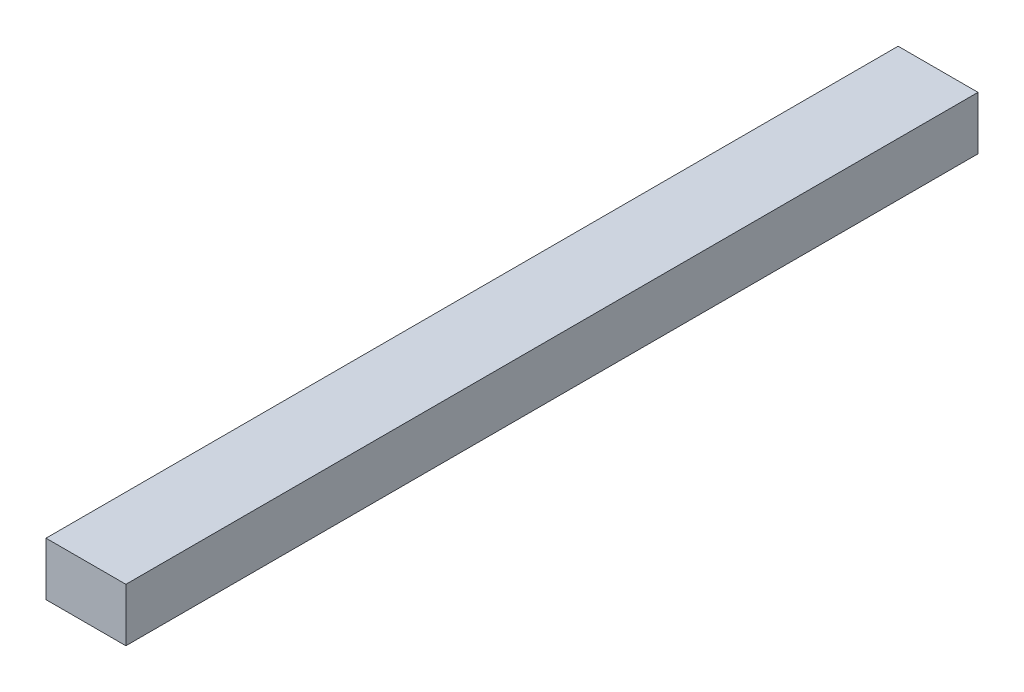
from build123d import *

# Parameters (mm, degrees)
SKETCH1_W           = 6
SKETCH1_H           = 4
BOSS_EXTRUDE1_DEPTH = 32


with BuildPart() as part:
    # Sketch1 → Boss-Extrude1 (new, symmetric)
    with BuildSketch(Plane.XY):
        Rectangle(SKETCH1_W, SKETCH1_H)
    extrude(amount=BOSS_EXTRUDE1_DEPTH, both=True)


solid = part.part
